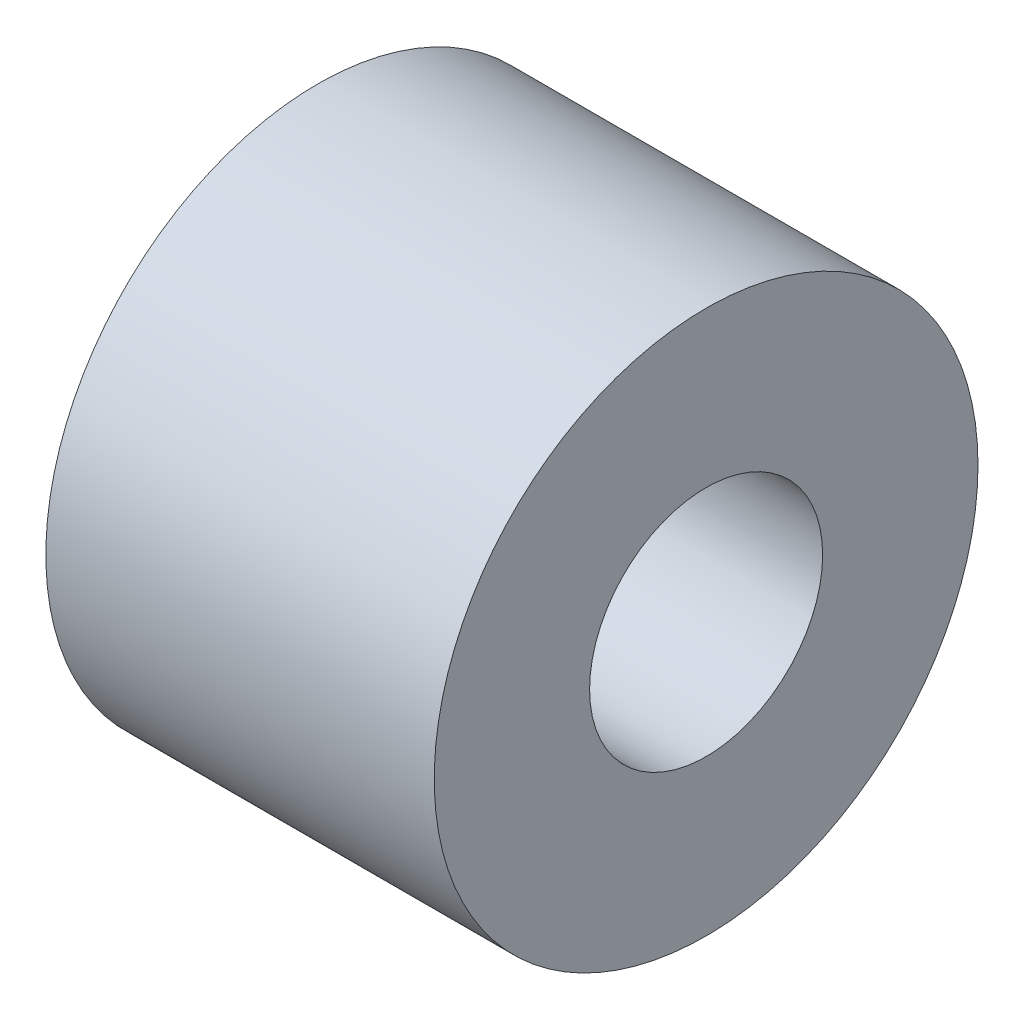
ISO-10303-21;
HEADER;
FILE_DESCRIPTION(('STEP AP214'),'2;1');
FILE_NAME('part.step','',(''),(''),'','','');
FILE_SCHEMA(('AUTOMOTIVE_DESIGN { 1 0 10303 214 1 1 1 1 }'));
ENDSEC;
DATA;
#1=APPLICATION_CONTEXT('core data for automotive mechanical design processes');
#2=APPLICATION_PROTOCOL_DEFINITION('international standard','automotive_design',2000,#1);
#3=PRODUCT_CONTEXT('',#1,'mechanical');
#4=PRODUCT('Part','Part','',(#3));
#5=PRODUCT_RELATED_PRODUCT_CATEGORY('part','',(#4));
#6=PRODUCT_DEFINITION_FORMATION('','',#4);
#7=PRODUCT_DEFINITION_CONTEXT('part definition',#1,'design');
#8=PRODUCT_DEFINITION('design','',#6,#7);
#9=PRODUCT_DEFINITION_SHAPE('','',#8);
#10=(LENGTH_UNIT() NAMED_UNIT(*) SI_UNIT(.MILLI.,.METRE.));
#11=(NAMED_UNIT(*) PLANE_ANGLE_UNIT() SI_UNIT($,.RADIAN.));
#12=(NAMED_UNIT(*) SI_UNIT($,.STERADIAN.) SOLID_ANGLE_UNIT());
#13=UNCERTAINTY_MEASURE_WITH_UNIT(LENGTH_MEASURE(1.E-05),#10,'distance_accuracy_value','');
#14=(GEOMETRIC_REPRESENTATION_CONTEXT(3) GLOBAL_UNCERTAINTY_ASSIGNED_CONTEXT((#13)) GLOBAL_UNIT_ASSIGNED_CONTEXT((#10,
#11,#12)) REPRESENTATION_CONTEXT('',''));
#15=CARTESIAN_POINT('',(0.,0.,0.));
#16=DIRECTION('',(0.,0.,1.));
#17=DIRECTION('',(1.,0.,0.));
#18=AXIS2_PLACEMENT_3D('',#15,#16,#17);
#19=CARTESIAN_POINT('',(5.,0.,0.));
#20=DIRECTION('',(-1.,0.,0.));
#21=DIRECTION('',(0.,0.,1.));
#22=AXIS2_PLACEMENT_3D('',#19,#20,#21);
#23=CYLINDRICAL_SURFACE('',#22,3.5);
#24=CARTESIAN_POINT('',(5.,0.,0.));
#25=DIRECTION('',(1.,0.,0.));
#26=DIRECTION('',(0.,0.,-1.));
#27=AXIS2_PLACEMENT_3D('',#24,#25,#26);
#28=CIRCLE('',#27,3.5);
#29=CARTESIAN_POINT('',(5.,0.,-3.5));
#30=VERTEX_POINT('',#29);
#31=EDGE_CURVE('E10',#30,#30,#28,.T.);
#32=ORIENTED_EDGE('',*,*,#31,.F.);
#33=EDGE_LOOP('',(#32));
#34=FACE_BOUND('',#33,.T.);
#35=CARTESIAN_POINT('',(0.,0.,0.));
#36=DIRECTION('',(1.,0.,0.));
#37=DIRECTION('',(0.,0.,-1.));
#38=AXIS2_PLACEMENT_3D('',#35,#36,#37);
#39=CIRCLE('',#38,3.5);
#40=CARTESIAN_POINT('',(0.,0.,-3.5));
#41=VERTEX_POINT('',#40);
#42=EDGE_CURVE('E44',#41,#41,#39,.T.);
#43=ORIENTED_EDGE('',*,*,#42,.T.);
#44=EDGE_LOOP('',(#43));
#45=FACE_BOUND('',#44,.T.);
#46=ADVANCED_FACE('F41',(#34,#45),#23,.T.);
#47=CARTESIAN_POINT('',(5.,0.,0.));
#48=DIRECTION('',(1.,0.,0.));
#49=DIRECTION('',(0.,0.,-1.));
#50=AXIS2_PLACEMENT_3D('',#47,#48,#49);
#51=PLANE('',#50);
#52=CARTESIAN_POINT('',(5.,0.,0.));
#53=DIRECTION('',(1.,0.,0.));
#54=DIRECTION('',(0.,0.,-1.));
#55=AXIS2_PLACEMENT_3D('',#52,#53,#54);
#56=CIRCLE('',#55,1.5);
#57=CARTESIAN_POINT('',(5.,0.,-1.5));
#58=VERTEX_POINT('',#57);
#59=EDGE_CURVE('E55',#58,#58,#56,.T.);
#60=ORIENTED_EDGE('',*,*,#59,.F.);
#61=EDGE_LOOP('',(#60));
#62=FACE_BOUND('',#61,.T.);
#63=ORIENTED_EDGE('',*,*,#31,.T.);
#64=EDGE_LOOP('',(#63));
#65=FACE_BOUND('',#64,.T.);
#66=ADVANCED_FACE('F72',(#62,#65),#51,.T.);
#67=CARTESIAN_POINT('',(0.,0.,0.));
#68=DIRECTION('',(1.,0.,0.));
#69=DIRECTION('',(0.,0.,-1.));
#70=AXIS2_PLACEMENT_3D('',#67,#68,#69);
#71=PLANE('',#70);
#72=ORIENTED_EDGE('',*,*,#42,.F.);
#73=EDGE_LOOP('',(#72));
#74=FACE_BOUND('',#73,.T.);
#75=ADVANCED_FACE('F68',(#74),#71,.F.);
#76=CARTESIAN_POINT('',(1.,0.,0.));
#77=DIRECTION('',(1.,0.,0.));
#78=DIRECTION('',(0.,0.,-1.));
#79=AXIS2_PLACEMENT_3D('',#76,#77,#78);
#80=CYLINDRICAL_SURFACE('',#79,1.5);
#81=CARTESIAN_POINT('',(1.,0.,0.));
#82=DIRECTION('',(1.,0.,0.));
#83=DIRECTION('',(0.,0.,-1.));
#84=AXIS2_PLACEMENT_3D('',#81,#82,#83);
#85=CIRCLE('',#84,1.5);
#86=CARTESIAN_POINT('',(1.,0.,-1.5));
#87=VERTEX_POINT('',#86);
#88=EDGE_CURVE('E53',#87,#87,#85,.T.);
#89=ORIENTED_EDGE('',*,*,#88,.F.);
#90=EDGE_LOOP('',(#89));
#91=FACE_BOUND('',#90,.T.);
#92=ORIENTED_EDGE('',*,*,#59,.T.);
#93=EDGE_LOOP('',(#92));
#94=FACE_BOUND('',#93,.T.);
#95=ADVANCED_FACE('F65',(#91,#94),#80,.F.);
#96=CARTESIAN_POINT('',(1.,0.,0.));
#97=DIRECTION('',(1.,0.,0.));
#98=DIRECTION('',(0.,0.,-1.));
#99=AXIS2_PLACEMENT_3D('',#96,#97,#98);
#100=PLANE('',#99);
#101=ORIENTED_EDGE('',*,*,#88,.T.);
#102=EDGE_LOOP('',(#101));
#103=FACE_BOUND('',#102,.T.);
#104=ADVANCED_FACE('F63',(#103),#100,.T.);
#105=CLOSED_SHELL('',(#46,#66,#75,#95,#104));
#106=MANIFOLD_SOLID_BREP('B2',#105);
#107=ADVANCED_BREP_SHAPE_REPRESENTATION('',(#18,#106),#14);
#108=SHAPE_DEFINITION_REPRESENTATION(#9,#107);
ENDSEC;
END-ISO-10303-21;
